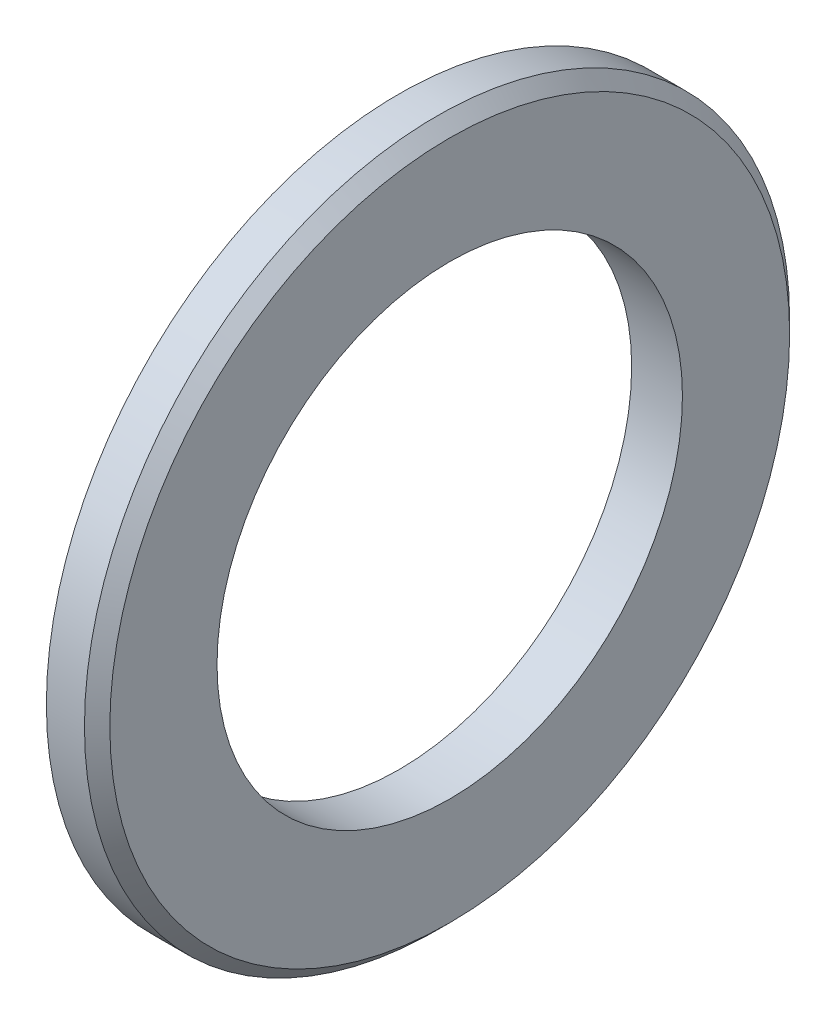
from build123d import *

# Parameters (mm, degrees)
SKETCH1_W      = 18
SKETCH1_H      = 42.5
ODCHAMFER_SIZE = 4.5


with BuildPart() as part:
    # Sketch1 → Base-Revolve (revolve)
    with BuildSketch(Plane.XY, mode=Mode.PRIVATE) as base_revolve_sk:
        with Locations((-9, 103.75)):
            Rectangle(SKETCH1_W, SKETCH1_H)
    revolve(base_revolve_sk.sketch.rotate(Axis((-34.925, 0, 0), (1, 0, 0)), 90), axis=Axis((-34.925, 0, 0), (1, 0, 0)))

    # ODChamfer
    odchamfer_edges = [part.edges().sort_by_distance(p)[0] for p in [
        (0, 0, -125),
    ]]
    chamfer(odchamfer_edges, length=ODCHAMFER_SIZE)


solid = part.part
